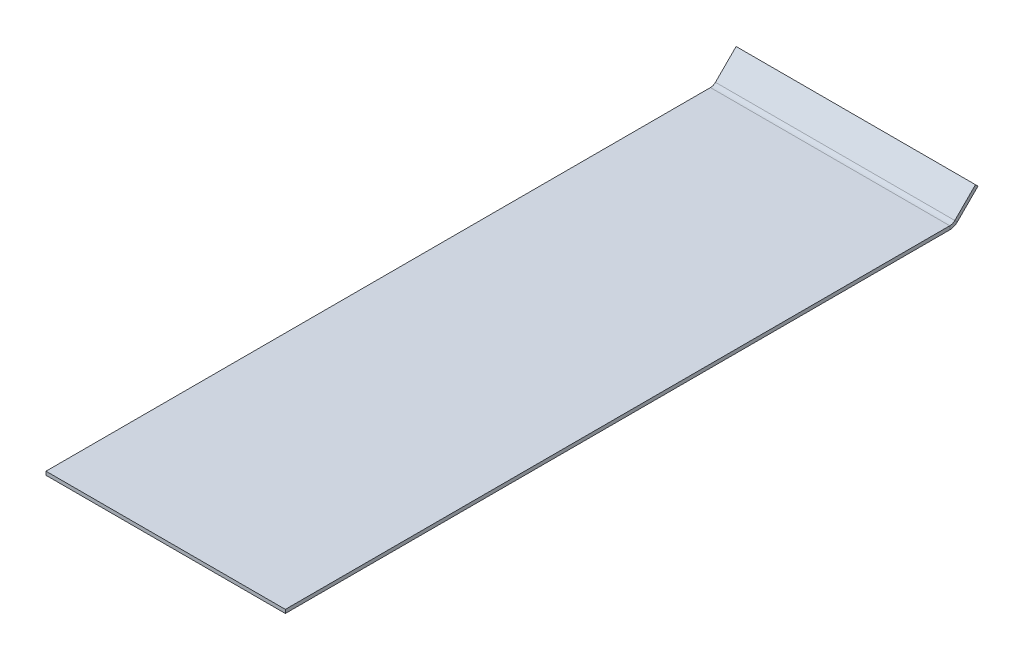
ISO-10303-21;
HEADER;
FILE_DESCRIPTION(('STEP AP214'),'2;1');
FILE_NAME('part.step','',(''),(''),'','','');
FILE_SCHEMA(('AUTOMOTIVE_DESIGN { 1 0 10303 214 1 1 1 1 }'));
ENDSEC;
DATA;
#1=APPLICATION_CONTEXT('core data for automotive mechanical design processes');
#2=APPLICATION_PROTOCOL_DEFINITION('international standard','automotive_design',2000,#1);
#3=PRODUCT_CONTEXT('',#1,'mechanical');
#4=PRODUCT('Part','Part','',(#3));
#5=PRODUCT_RELATED_PRODUCT_CATEGORY('part','',(#4));
#6=PRODUCT_DEFINITION_FORMATION('','',#4);
#7=PRODUCT_DEFINITION_CONTEXT('part definition',#1,'design');
#8=PRODUCT_DEFINITION('design','',#6,#7);
#9=PRODUCT_DEFINITION_SHAPE('','',#8);
#10=(LENGTH_UNIT() NAMED_UNIT(*) SI_UNIT(.MILLI.,.METRE.));
#11=(NAMED_UNIT(*) PLANE_ANGLE_UNIT() SI_UNIT($,.RADIAN.));
#12=(NAMED_UNIT(*) SI_UNIT($,.STERADIAN.) SOLID_ANGLE_UNIT());
#13=UNCERTAINTY_MEASURE_WITH_UNIT(LENGTH_MEASURE(1.E-05),#10,'distance_accuracy_value','');
#14=(GEOMETRIC_REPRESENTATION_CONTEXT(3) GLOBAL_UNCERTAINTY_ASSIGNED_CONTEXT((#13)) GLOBAL_UNIT_ASSIGNED_CONTEXT((#10,
#11,#12)) REPRESENTATION_CONTEXT('',''));
#15=CARTESIAN_POINT('',(0.,0.,0.));
#16=DIRECTION('',(0.,0.,1.));
#17=DIRECTION('',(1.,0.,0.));
#18=AXIS2_PLACEMENT_3D('',#15,#16,#17);
#19=CARTESIAN_POINT('',(392.392830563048,27.5837958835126,-244.791310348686));
#20=DIRECTION('',(0.,0.70710678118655,0.707106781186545));
#21=DIRECTION('',(0.,-0.707106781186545,0.70710678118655));
#22=AXIS2_PLACEMENT_3D('',#19,#20,#21);
#23=PLANE('',#22);
#24=DIRECTION('',(0.,0.707106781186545,-0.70710678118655));
#25=VECTOR('',#24,1.);
#26=CARTESIAN_POINT('',(290.792830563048,27.5837958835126,-244.791310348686));
#27=LINE('',#26,#25);
#28=CARTESIAN_POINT('',(290.792830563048,27.5837958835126,-244.791310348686));
#29=VERTEX_POINT('',#28);
#30=CARTESIAN_POINT('',(290.792830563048,36.3571162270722,-253.564630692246));
#31=VERTEX_POINT('',#30);
#32=EDGE_CURVE('E52',#29,#31,#27,.T.);
#33=ORIENTED_EDGE('',*,*,#32,.T.);
#34=DIRECTION('',(-1.,0.,0.));
#35=VECTOR('',#34,1.);
#36=CARTESIAN_POINT('',(392.392830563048,36.3571162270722,-253.564630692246));
#37=LINE('',#36,#35);
#38=CARTESIAN_POINT('',(392.392830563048,36.3571162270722,-253.564630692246));
#39=VERTEX_POINT('',#38);
#40=EDGE_CURVE('E123',#39,#31,#37,.T.);
#41=ORIENTED_EDGE('',*,*,#40,.F.);
#42=DIRECTION('',(0.,0.707106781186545,-0.70710678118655));
#43=VECTOR('',#42,1.);
#44=CARTESIAN_POINT('',(392.392830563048,27.5837958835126,-244.791310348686));
#45=LINE('',#44,#43);
#46=CARTESIAN_POINT('',(392.392830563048,27.5837958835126,-244.791310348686));
#47=VERTEX_POINT('',#46);
#48=EDGE_CURVE('E112',#47,#39,#45,.T.);
#49=ORIENTED_EDGE('',*,*,#48,.F.);
#50=DIRECTION('',(-1.,0.,0.));
#51=VECTOR('',#50,1.);
#52=CARTESIAN_POINT('',(392.392830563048,27.5837958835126,-244.791310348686));
#53=LINE('',#52,#51);
#54=EDGE_CURVE('E103',#47,#29,#53,.T.);
#55=ORIENTED_EDGE('',*,*,#54,.T.);
#56=EDGE_LOOP('',(#33,#41,#49,#55));
#57=FACE_BOUND('',#56,.T.);
#58=ADVANCED_FACE('F37',(#57),#23,.F.);
#59=CARTESIAN_POINT('',(290.792830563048,173.41295372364,-98.96215250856));
#60=DIRECTION('',(-1.,0.,0.));
#61=DIRECTION('',(0.,-0.707106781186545,0.70710678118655));
#62=AXIS2_PLACEMENT_3D('',#59,#60,#61);
#63=PLANE('',#62);
#64=ORIENTED_EDGE('',*,*,#32,.F.);
#65=DIRECTION('',(0.,-0.70710678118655,-0.707106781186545));
#66=VECTOR('',#65,1.);
#67=CARTESIAN_POINT('',(290.792830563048,173.41295372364,-98.96215250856));
#68=LINE('',#67,#66);
#69=CARTESIAN_POINT('',(290.792830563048,28.6614266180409,-243.713679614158));
#70=VERTEX_POINT('',#69);
#71=EDGE_CURVE('E11',#70,#29,#68,.T.);
#72=ORIENTED_EDGE('',*,*,#71,.F.);
#73=DIRECTION('',(0.,0.707106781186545,-0.70710678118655));
#74=VECTOR('',#73,1.);
#75=CARTESIAN_POINT('',(290.792830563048,28.6614266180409,-243.713679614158));
#76=LINE('',#75,#74);
#77=CARTESIAN_POINT('',(290.792830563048,37.4347469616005,-252.486999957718));
#78=VERTEX_POINT('',#77);
#79=EDGE_CURVE('E111',#70,#78,#76,.T.);
#80=ORIENTED_EDGE('',*,*,#79,.T.);
#81=DIRECTION('',(0.,-0.70710678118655,-0.707106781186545));
#82=VECTOR('',#81,1.);
#83=CARTESIAN_POINT('',(290.792830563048,182.1862740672,-107.73547285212));
#84=LINE('',#83,#82);
#85=EDGE_CURVE('E132',#78,#31,#84,.T.);
#86=ORIENTED_EDGE('',*,*,#85,.T.);
#87=EDGE_LOOP('',(#64,#72,#80,#86));
#88=FACE_BOUND('',#87,.T.);
#89=ADVANCED_FACE('F39',(#88),#63,.T.);
#90=CARTESIAN_POINT('',(392.392830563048,173.41295372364,-98.96215250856));
#91=DIRECTION('',(-1.,0.,0.));
#92=DIRECTION('',(0.,-0.707106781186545,0.70710678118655));
#93=AXIS2_PLACEMENT_3D('',#90,#91,#92);
#94=PLANE('',#93);
#95=DIRECTION('',(0.,-0.70710678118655,-0.707106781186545));
#96=VECTOR('',#95,1.);
#97=CARTESIAN_POINT('',(392.392830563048,173.41295372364,-98.96215250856));
#98=LINE('',#97,#96);
#99=CARTESIAN_POINT('',(392.392830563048,28.6614266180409,-243.713679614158));
#100=VERTEX_POINT('',#99);
#101=EDGE_CURVE('E45',#100,#47,#98,.T.);
#102=ORIENTED_EDGE('',*,*,#101,.T.);
#103=ORIENTED_EDGE('',*,*,#48,.T.);
#104=DIRECTION('',(0.,-0.70710678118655,-0.707106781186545));
#105=VECTOR('',#104,1.);
#106=CARTESIAN_POINT('',(392.392830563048,182.1862740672,-107.73547285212));
#107=LINE('',#106,#105);
#108=CARTESIAN_POINT('',(392.392830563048,37.4347469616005,-252.486999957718));
#109=VERTEX_POINT('',#108);
#110=EDGE_CURVE('E131',#109,#39,#107,.T.);
#111=ORIENTED_EDGE('',*,*,#110,.F.);
#112=DIRECTION('',(0.,0.707106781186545,-0.70710678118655));
#113=VECTOR('',#112,1.);
#114=CARTESIAN_POINT('',(392.392830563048,28.6614266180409,-243.713679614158));
#115=LINE('',#114,#113);
#116=EDGE_CURVE('E129',#100,#109,#115,.T.);
#117=ORIENTED_EDGE('',*,*,#116,.F.);
#118=EDGE_LOOP('',(#102,#103,#111,#117));
#119=FACE_BOUND('',#118,.T.);
#120=ADVANCED_FACE('F127',(#119),#94,.F.);
#121=CARTESIAN_POINT('',(392.392830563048,182.1862740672,-107.73547285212));
#122=DIRECTION('',(0.,-0.707106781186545,0.70710678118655));
#123=DIRECTION('',(0.,-0.70710678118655,-0.707106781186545));
#124=AXIS2_PLACEMENT_3D('',#121,#122,#123);
#125=PLANE('',#124);
#126=ORIENTED_EDGE('',*,*,#110,.T.);
#127=ORIENTED_EDGE('',*,*,#40,.T.);
#128=ORIENTED_EDGE('',*,*,#85,.F.);
#129=DIRECTION('',(-1.,0.,0.));
#130=VECTOR('',#129,1.);
#131=CARTESIAN_POINT('',(392.392830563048,37.4347469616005,-252.486999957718));
#132=LINE('',#131,#130);
#133=EDGE_CURVE('E60',#109,#78,#132,.T.);
#134=ORIENTED_EDGE('',*,*,#133,.F.);
#135=EDGE_LOOP('',(#126,#127,#128,#134));
#136=FACE_BOUND('',#135,.T.);
#137=ADVANCED_FACE('F205',(#136),#125,.F.);
#138=CARTESIAN_POINT('',(392.392830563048,28.6614266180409,-243.713679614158));
#139=DIRECTION('',(0.,0.70710678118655,0.707106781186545));
#140=DIRECTION('',(0.,-0.707106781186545,0.70710678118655));
#141=AXIS2_PLACEMENT_3D('',#138,#139,#140);
#142=PLANE('',#141);
#143=ORIENTED_EDGE('',*,*,#79,.F.);
#144=DIRECTION('',(-1.,0.,0.));
#145=VECTOR('',#144,1.);
#146=CARTESIAN_POINT('',(392.392830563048,28.6614266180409,-243.713679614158));
#147=LINE('',#146,#145);
#148=EDGE_CURVE('E139',#100,#70,#147,.T.);
#149=ORIENTED_EDGE('',*,*,#148,.F.);
#150=ORIENTED_EDGE('',*,*,#116,.T.);
#151=ORIENTED_EDGE('',*,*,#133,.T.);
#152=EDGE_LOOP('',(#143,#149,#150,#151));
#153=FACE_BOUND('',#152,.T.);
#154=ADVANCED_FACE('F207',(#153),#142,.T.);
#155=CARTESIAN_POINT('',(392.392830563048,627.359233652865,40.4545000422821));
#156=DIRECTION('',(0.,0.,1.));
#157=DIRECTION('',(1.,0.,0.));
#158=AXIS2_PLACEMENT_3D('',#155,#156,#157);
#159=PLANE('',#158);
#160=DIRECTION('',(-1.,0.,0.));
#161=VECTOR('',#160,1.);
#162=CARTESIAN_POINT('',(392.392830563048,26.2587469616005,40.4545000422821));
#163=LINE('',#162,#161);
#164=CARTESIAN_POINT('',(392.392830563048,26.2587469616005,40.4545000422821));
#165=VERTEX_POINT('',#164);
#166=CARTESIAN_POINT('',(290.792830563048,26.2587469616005,40.4545000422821));
#167=VERTEX_POINT('',#166);
#168=EDGE_CURVE('E169',#165,#167,#163,.T.);
#169=ORIENTED_EDGE('',*,*,#168,.F.);
#170=DIRECTION('',(0.,-1.,0.));
#171=VECTOR('',#170,1.);
#172=CARTESIAN_POINT('',(392.392830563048,627.359233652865,40.4545000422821));
#173=LINE('',#172,#171);
#174=CARTESIAN_POINT('',(392.392830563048,27.7827469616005,40.4545000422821));
#175=VERTEX_POINT('',#174);
#176=EDGE_CURVE('E171',#175,#165,#173,.T.);
#177=ORIENTED_EDGE('',*,*,#176,.F.);
#178=DIRECTION('',(-1.,0.,0.));
#179=VECTOR('',#178,1.);
#180=CARTESIAN_POINT('',(392.392830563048,27.7827469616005,40.4545000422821));
#181=LINE('',#180,#179);
#182=CARTESIAN_POINT('',(290.792830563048,27.7827469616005,40.4545000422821));
#183=VERTEX_POINT('',#182);
#184=EDGE_CURVE('E149',#175,#183,#181,.T.);
#185=ORIENTED_EDGE('',*,*,#184,.T.);
#186=DIRECTION('',(0.,-1.,0.));
#187=VECTOR('',#186,1.);
#188=CARTESIAN_POINT('',(290.792830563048,627.359233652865,40.4545000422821));
#189=LINE('',#188,#187);
#190=EDGE_CURVE('E151',#183,#167,#189,.T.);
#191=ORIENTED_EDGE('',*,*,#190,.T.);
#192=EDGE_LOOP('',(#169,#177,#185,#191));
#193=FACE_BOUND('',#192,.T.);
#194=ADVANCED_FACE('F194',(#193),#159,.T.);
#195=CARTESIAN_POINT('',(392.392830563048,27.7827469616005,40.4545000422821));
#196=DIRECTION('',(0.,1.,0.));
#197=DIRECTION('',(0.,0.,1.));
#198=AXIS2_PLACEMENT_3D('',#195,#196,#197);
#199=PLANE('',#198);
#200=DIRECTION('',(0.,0.,-1.));
#201=VECTOR('',#200,1.);
#202=CARTESIAN_POINT('',(290.792830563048,27.7827469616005,40.4545000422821));
#203=LINE('',#202,#201);
#204=CARTESIAN_POINT('',(290.792830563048,27.7827469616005,-241.592359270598));
#205=VERTEX_POINT('',#204);
#206=EDGE_CURVE('E160',#183,#205,#203,.T.);
#207=ORIENTED_EDGE('',*,*,#206,.F.);
#208=ORIENTED_EDGE('',*,*,#184,.F.);
#209=DIRECTION('',(0.,0.,-1.));
#210=VECTOR('',#209,1.);
#211=CARTESIAN_POINT('',(392.392830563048,27.7827469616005,40.4545000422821));
#212=LINE('',#211,#210);
#213=CARTESIAN_POINT('',(392.392830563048,27.7827469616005,-241.592359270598));
#214=VERTEX_POINT('',#213);
#215=EDGE_CURVE('E154',#175,#214,#212,.T.);
#216=ORIENTED_EDGE('',*,*,#215,.T.);
#217=DIRECTION('',(-1.,0.,0.));
#218=VECTOR('',#217,1.);
#219=CARTESIAN_POINT('',(392.392830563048,27.7827469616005,-241.592359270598));
#220=LINE('',#219,#218);
#221=EDGE_CURVE('E157',#214,#205,#220,.T.);
#222=ORIENTED_EDGE('',*,*,#221,.T.);
#223=EDGE_LOOP('',(#207,#208,#216,#222));
#224=FACE_BOUND('',#223,.T.);
#225=ADVANCED_FACE('F190',(#224),#199,.T.);
#226=CARTESIAN_POINT('',(290.792830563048,627.359233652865,40.4545000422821));
#227=DIRECTION('',(-1.,0.,0.));
#228=DIRECTION('',(0.,0.,1.));
#229=AXIS2_PLACEMENT_3D('',#226,#227,#228);
#230=PLANE('',#229);
#231=DIRECTION('',(0.,0.,-1.));
#232=VECTOR('',#231,1.);
#233=CARTESIAN_POINT('',(290.792830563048,26.2587469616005,40.4545000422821));
#234=LINE('',#233,#232);
#235=CARTESIAN_POINT('',(290.792830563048,26.2587469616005,-241.592359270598));
#236=VERTEX_POINT('',#235);
#237=EDGE_CURVE('E166',#167,#236,#234,.T.);
#238=ORIENTED_EDGE('',*,*,#237,.F.);
#239=ORIENTED_EDGE('',*,*,#190,.F.);
#240=ORIENTED_EDGE('',*,*,#206,.T.);
#241=DIRECTION('',(0.,-1.,0.));
#242=VECTOR('',#241,1.);
#243=CARTESIAN_POINT('',(290.792830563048,627.359233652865,-241.592359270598));
#244=LINE('',#243,#242);
#245=EDGE_CURVE('E163',#205,#236,#244,.T.);
#246=ORIENTED_EDGE('',*,*,#245,.T.);
#247=EDGE_LOOP('',(#238,#239,#240,#246));
#248=FACE_BOUND('',#247,.T.);
#249=ADVANCED_FACE('F197',(#248),#230,.T.);
#250=CARTESIAN_POINT('',(392.392830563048,26.2587469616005,40.4545000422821));
#251=DIRECTION('',(0.,1.,0.));
#252=DIRECTION('',(0.,0.,1.));
#253=AXIS2_PLACEMENT_3D('',#250,#251,#252);
#254=PLANE('',#253);
#255=ORIENTED_EDGE('',*,*,#237,.T.);
#256=DIRECTION('',(-1.,0.,0.));
#257=VECTOR('',#256,1.);
#258=CARTESIAN_POINT('',(392.392830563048,26.2587469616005,-241.592359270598));
#259=LINE('',#258,#257);
#260=CARTESIAN_POINT('',(392.392830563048,26.2587469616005,-241.592359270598));
#261=VERTEX_POINT('',#260);
#262=EDGE_CURVE('E147',#261,#236,#259,.T.);
#263=ORIENTED_EDGE('',*,*,#262,.F.);
#264=DIRECTION('',(0.,0.,-1.));
#265=VECTOR('',#264,1.);
#266=CARTESIAN_POINT('',(392.392830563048,26.2587469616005,40.4545000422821));
#267=LINE('',#266,#265);
#268=EDGE_CURVE('E145',#165,#261,#267,.T.);
#269=ORIENTED_EDGE('',*,*,#268,.F.);
#270=ORIENTED_EDGE('',*,*,#168,.T.);
#271=EDGE_LOOP('',(#255,#263,#269,#270));
#272=FACE_BOUND('',#271,.T.);
#273=ADVANCED_FACE('F199',(#272),#254,.F.);
#274=CARTESIAN_POINT('',(392.392830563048,627.359233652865,40.4545000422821));
#275=DIRECTION('',(-1.,0.,0.));
#276=DIRECTION('',(0.,0.,1.));
#277=AXIS2_PLACEMENT_3D('',#274,#275,#276);
#278=PLANE('',#277);
#279=ORIENTED_EDGE('',*,*,#176,.T.);
#280=ORIENTED_EDGE('',*,*,#268,.T.);
#281=DIRECTION('',(0.,-1.,0.));
#282=VECTOR('',#281,1.);
#283=CARTESIAN_POINT('',(392.392830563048,627.359233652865,-241.592359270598));
#284=LINE('',#283,#282);
#285=EDGE_CURVE('E119',#214,#261,#284,.T.);
#286=ORIENTED_EDGE('',*,*,#285,.F.);
#287=ORIENTED_EDGE('',*,*,#215,.F.);
#288=EDGE_LOOP('',(#279,#280,#286,#287));
#289=FACE_BOUND('',#288,.T.);
#290=ADVANCED_FACE('F187',(#289),#278,.F.);
#291=CARTESIAN_POINT('',(290.792830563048,30.7827469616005,-241.592359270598));
#292=DIRECTION('',(-1.,0.,0.));
#293=DIRECTION('',(0.,0.,1.));
#294=AXIS2_PLACEMENT_3D('',#291,#292,#293);
#295=PLANE('',#294);
#296=ORIENTED_EDGE('',*,*,#245,.F.);
#297=CARTESIAN_POINT('',(290.792830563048,30.7827469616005,-241.592359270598));
#298=DIRECTION('',(-1.,0.,0.));
#299=DIRECTION('',(0.,0.,1.));
#300=AXIS2_PLACEMENT_3D('',#297,#298,#299);
#301=CIRCLE('',#300,2.99999999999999);
#302=EDGE_CURVE('E120',#205,#70,#301,.F.);
#303=ORIENTED_EDGE('',*,*,#302,.T.);
#304=ORIENTED_EDGE('',*,*,#71,.T.);
#305=CARTESIAN_POINT('',(290.792830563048,30.7827469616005,-241.592359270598));
#306=DIRECTION('',(-1.,0.,0.));
#307=DIRECTION('',(0.,0.,1.));
#308=AXIS2_PLACEMENT_3D('',#305,#306,#307);
#309=CIRCLE('',#308,4.52399999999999);
#310=EDGE_CURVE('E109',#236,#29,#309,.F.);
#311=ORIENTED_EDGE('',*,*,#310,.F.);
#312=EDGE_LOOP('',(#296,#303,#304,#311));
#313=FACE_BOUND('',#312,.T.);
#314=ADVANCED_FACE('F201',(#313),#295,.T.);
#315=CARTESIAN_POINT('',(392.392830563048,30.7827469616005,-241.592359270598));
#316=DIRECTION('',(1.,0.,0.));
#317=DIRECTION('',(0.,0.,-1.));
#318=AXIS2_PLACEMENT_3D('',#315,#316,#317);
#319=PLANE('',#318);
#320=ORIENTED_EDGE('',*,*,#101,.F.);
#321=CARTESIAN_POINT('',(392.392830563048,30.7827469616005,-241.592359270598));
#322=DIRECTION('',(-1.,0.,0.));
#323=DIRECTION('',(0.,0.,1.));
#324=AXIS2_PLACEMENT_3D('',#321,#322,#323);
#325=CIRCLE('',#324,2.99999999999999);
#326=EDGE_CURVE('E178',#100,#214,#325,.T.);
#327=ORIENTED_EDGE('',*,*,#326,.T.);
#328=ORIENTED_EDGE('',*,*,#285,.T.);
#329=CARTESIAN_POINT('',(392.392830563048,30.7827469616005,-241.592359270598));
#330=DIRECTION('',(-1.,0.,0.));
#331=DIRECTION('',(0.,0.,1.));
#332=AXIS2_PLACEMENT_3D('',#329,#330,#331);
#333=CIRCLE('',#332,4.52399999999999);
#334=EDGE_CURVE('E106',#47,#261,#333,.T.);
#335=ORIENTED_EDGE('',*,*,#334,.F.);
#336=EDGE_LOOP('',(#320,#327,#328,#335));
#337=FACE_BOUND('',#336,.T.);
#338=ADVANCED_FACE('F115',(#337),#319,.T.);
#339=CARTESIAN_POINT('',(706.556200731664,30.7827469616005,-241.592359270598));
#340=DIRECTION('',(-1.,0.,0.));
#341=DIRECTION('',(0.,0.,1.));
#342=AXIS2_PLACEMENT_3D('',#339,#340,#341);
#343=CYLINDRICAL_SURFACE('',#342,4.52399999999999);
#344=ORIENTED_EDGE('',*,*,#334,.T.);
#345=ORIENTED_EDGE('',*,*,#262,.T.);
#346=ORIENTED_EDGE('',*,*,#310,.T.);
#347=ORIENTED_EDGE('',*,*,#54,.F.);
#348=EDGE_LOOP('',(#344,#345,#346,#347));
#349=FACE_BOUND('',#348,.T.);
#350=ADVANCED_FACE('F105',(#349),#343,.T.);
#351=CARTESIAN_POINT('',(706.556200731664,30.7827469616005,-241.592359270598));
#352=DIRECTION('',(-1.,0.,0.));
#353=DIRECTION('',(0.,0.,1.));
#354=AXIS2_PLACEMENT_3D('',#351,#352,#353);
#355=CYLINDRICAL_SURFACE('',#354,2.99999999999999);
#356=ORIENTED_EDGE('',*,*,#326,.F.);
#357=ORIENTED_EDGE('',*,*,#148,.T.);
#358=ORIENTED_EDGE('',*,*,#302,.F.);
#359=ORIENTED_EDGE('',*,*,#221,.F.);
#360=EDGE_LOOP('',(#356,#357,#358,#359));
#361=FACE_BOUND('',#360,.T.);
#362=ADVANCED_FACE('F183',(#361),#355,.F.);
#363=CLOSED_SHELL('',(#58,#89,#120,#137,#154,#194,#225,#249,#273,#290,#314,#338,#350,#362));
#364=MANIFOLD_SOLID_BREP('B2',#363);
#365=ADVANCED_BREP_SHAPE_REPRESENTATION('',(#18,#364),#14);
#366=SHAPE_DEFINITION_REPRESENTATION(#9,#365);
ENDSEC;
END-ISO-10303-21;
